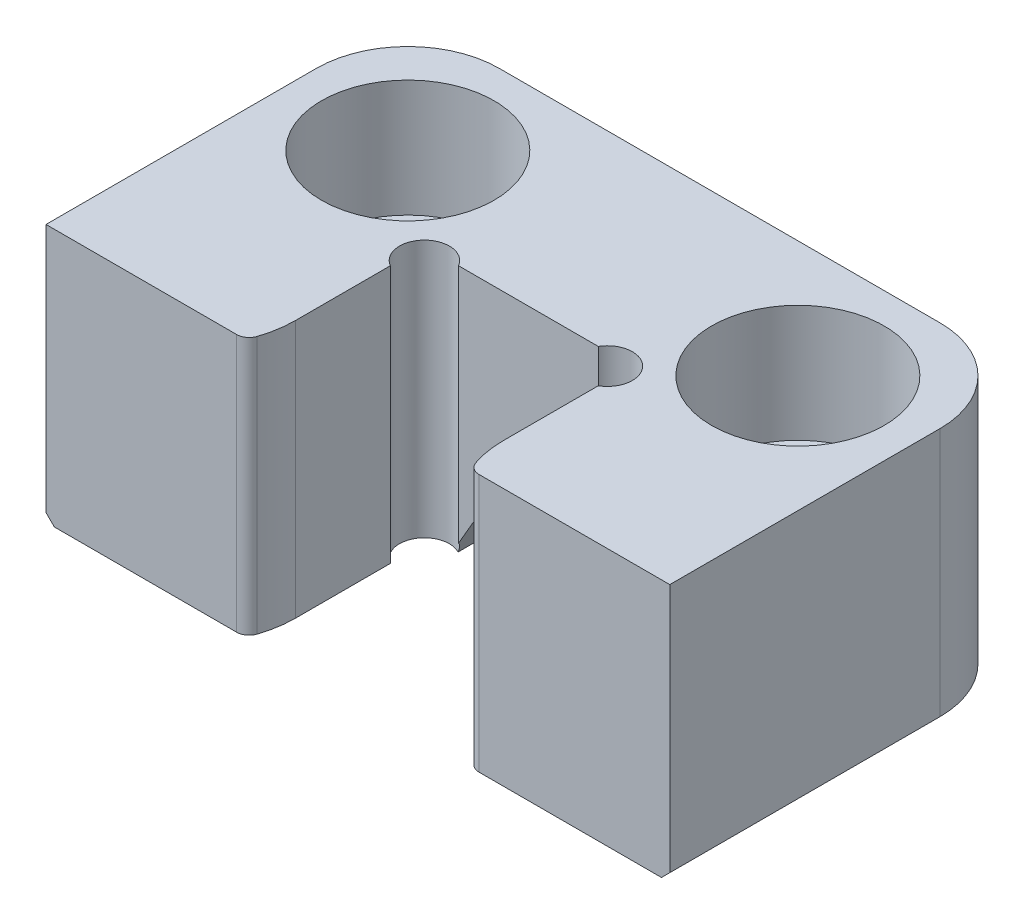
from build123d import *

# Parameters (mm, degrees)
BOSS_EXTRUDE1_DEPTH     = 15.748
FILLET1_R               = 5.588
CUT_EXTRUDE1_DEPTH      = 34.154541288
SKETCH3_R               = 1.524
CUT_EXTRUDE2_DEPTH      = 34.154541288
CUT_EXTRUDE3_DEPTH      = 34.154541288
CHAMFER1_SIZE           = 0.508
CHAMFER5_SIZE           = 3.81
CHAMFER5_SIZE2          = 1.020886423
F_1_4_CBORE_D           = 6.5278
F_1_4_CBORE_CBORE_D     = 10.541
F_1_4_CBORE_CBORE_DEPTH = 7.14375
FILLET2_R               = 0.762


with BuildPart() as part:
    # Sketch1 → Boss-Extrude1 (new body)
    with BuildSketch(Plane(origin=(0, 0, 0), x_dir=(1, 0, 0), z_dir=(0, 1, 0))):
        Polygon((6.35, 0), (19.05, 0), (19.05, 22.098), (-19.05, 22.098), (-19.05, 0), (-6.35, 0), (-6.35, 10.414), (6.35, 10.414), align=None)
    extrude(amount=-BOSS_EXTRUDE1_DEPTH)

    # Fillet1
    fillet1_edges = [part.edges().sort_by_distance(p)[0] for p in [
        (-19.05, -7.874, -22.098),
        (19.05, -7.874, -22.098),
    ]]
    fillet(fillet1_edges, radius=FILLET1_R)

    # Sketch2 → Cut-Extrude1 (cut, through all)
    with BuildSketch(Plane(origin=(0, 0, 0), x_dir=(1, 0, 0), z_dir=(0, 1, 0))):
        with BuildLine():
            Line((-6.35, 2.54), (-6.35, 3.457932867))
            Line((-6.35, 3.457932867), (6.35, 3.457932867))
            Line((6.35, 3.457932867), (6.35, 2.54))
            ThreePointArc((6.35, 2.54), (6.483944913, 1.242633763), (6.880128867, 0))
            Line((6.880128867, 0), (28.575, 0))
            Line((28.575, 0), (28.575, -12.7))
            Line((28.575, -12.7), (-28.575, -12.7))
            Line((-28.575, -12.7), (-28.575, 0))
            Line((-28.575, 0), (-6.880128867, 0))
            ThreePointArc((-6.880128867, 0), (-6.483944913, 1.242633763), (-6.35, 2.54))
        make_face()
    extrude(amount=-CUT_EXTRUDE1_DEPTH, mode=Mode.SUBTRACT)

    # Sketch3 → Cut-Extrude2 (cut, through all)
    with BuildSketch(Plane(origin=(0, 0, 0), x_dir=(1, 0, 0), z_dir=(0, 1, 0))):
        with Locations((-5.588, 9.652)):
            Circle(SKETCH3_R)
        with Locations((5.588, 9.652)):
            Circle(SKETCH3_R)
    extrude(amount=-CUT_EXTRUDE2_DEPTH, mode=Mode.SUBTRACT)

    # Sketch5 → Cut-Extrude3 (cut, through all)
    with BuildSketch(Plane(origin=(0, 0, -22.098), x_dir=(-1, 0, 0), z_dir=(0, 0, -1))):
        Polygon((-3.96875, -14.1605), (3.96875, -14.1605), (4.885293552, -15.748), (-4.885293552, -15.748), align=None)
    extrude(amount=-CUT_EXTRUDE3_DEPTH, mode=Mode.SUBTRACT)

    # Chamfer1
    chamfer1_edges = [part.edges().sort_by_distance(p)[0] for p in [
        (-9.173646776, -15.748, -22.098),
        (19.05, -15.748, -8.255),
        (9.173646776, -15.748, -22.098),
        (-19.05, -15.748, -8.255),
        (-17.413312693, -15.748, -20.461312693),
        (17.413312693, -15.748, -20.461312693),
    ]]
    chamfer(chamfer1_edges, length=CHAMFER1_SIZE)

    # Chamfer5
    chamfer5_edges = [part.edges().sort_by_distance(p)[0] for p in [
        (0, -14.1605, -10.414),
    ]]
    chamfer5_side = [part.faces().sort_by_distance(p)[0] for p in [
        (0, -14.1605, -16.256),
    ]]
    chamfer(chamfer5_edges, length=CHAMFER5_SIZE, length2=CHAMFER5_SIZE2, reference=chamfer5_side[0])

    # 1_4_ CBORE (through all)
    with Locations(Plane(origin=(9.083120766, 0, -5.226040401), x_dir=(-1, 0, 0), z_dir=(0, 1, 0))):
        with Locations((20.995720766, -9.734559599), (-2.829479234, -9.734559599)):
            CounterBoreHole(F_1_4_CBORE_D / 2, F_1_4_CBORE_CBORE_D / 2, F_1_4_CBORE_CBORE_DEPTH)

    # Fillet2
    fillet2_edges = [part.edges().sort_by_distance(p)[0] for p in [
        (-6.880128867, -7.874, 0),
        (6.880128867, -7.874, 0),
    ]]
    fillet(fillet2_edges, radius=FILLET2_R)


solid = part.part
